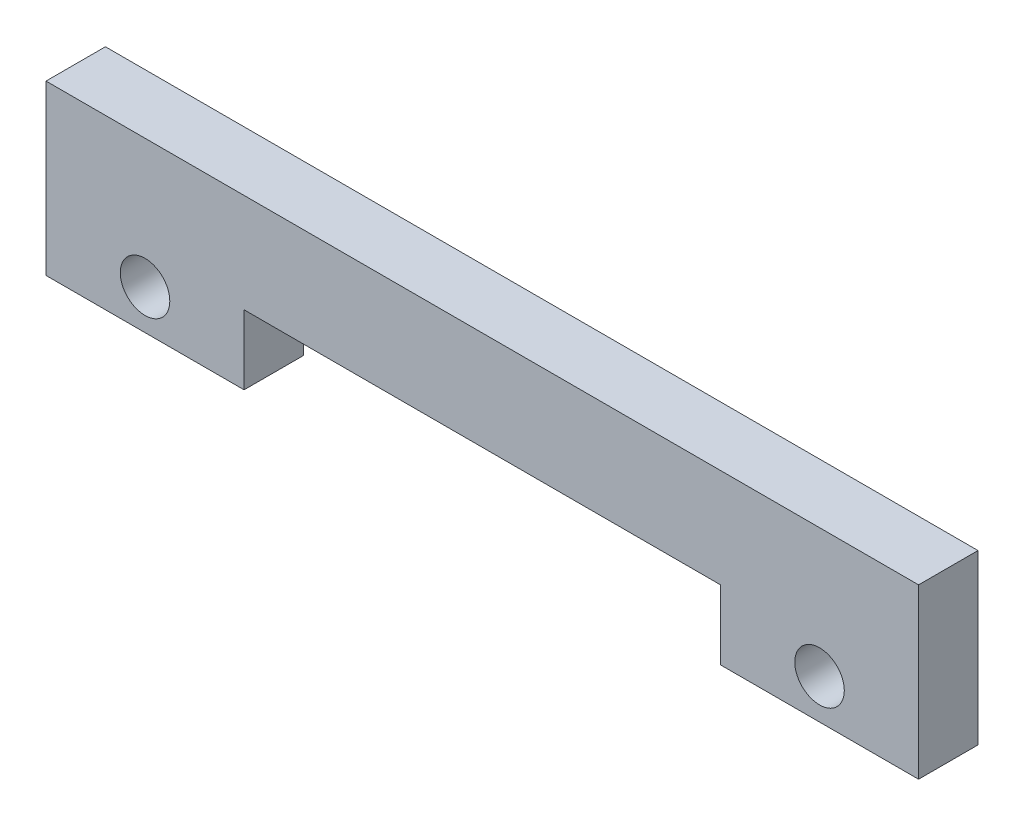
from build123d import *

# Parameters (mm, degrees)
SKETCH1_R           = 1.25
BOSS_EXTRUDE1_DEPTH = 3


with BuildPart() as part:
    # Sketch1 → Boss-Extrude1 (new body)
    with BuildSketch(Plane.XY):
        Polygon((87.413435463, 261.707308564), (87.413435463, 270.207308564), (43.361262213, 270.207308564), (43.361262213, 261.707308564), (53.361262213, 261.707308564), (53.361262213, 265.207308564), (77.413435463, 265.207308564), (77.413435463, 261.707308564), align=None)
        with Locations((48.361262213, 263.707308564)):
            Circle(SKETCH1_R, mode=Mode.SUBTRACT)
        with Locations((82.413435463, 263.707308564)):
            Circle(SKETCH1_R, mode=Mode.SUBTRACT)
    extrude(amount=BOSS_EXTRUDE1_DEPTH)


solid = part.part
